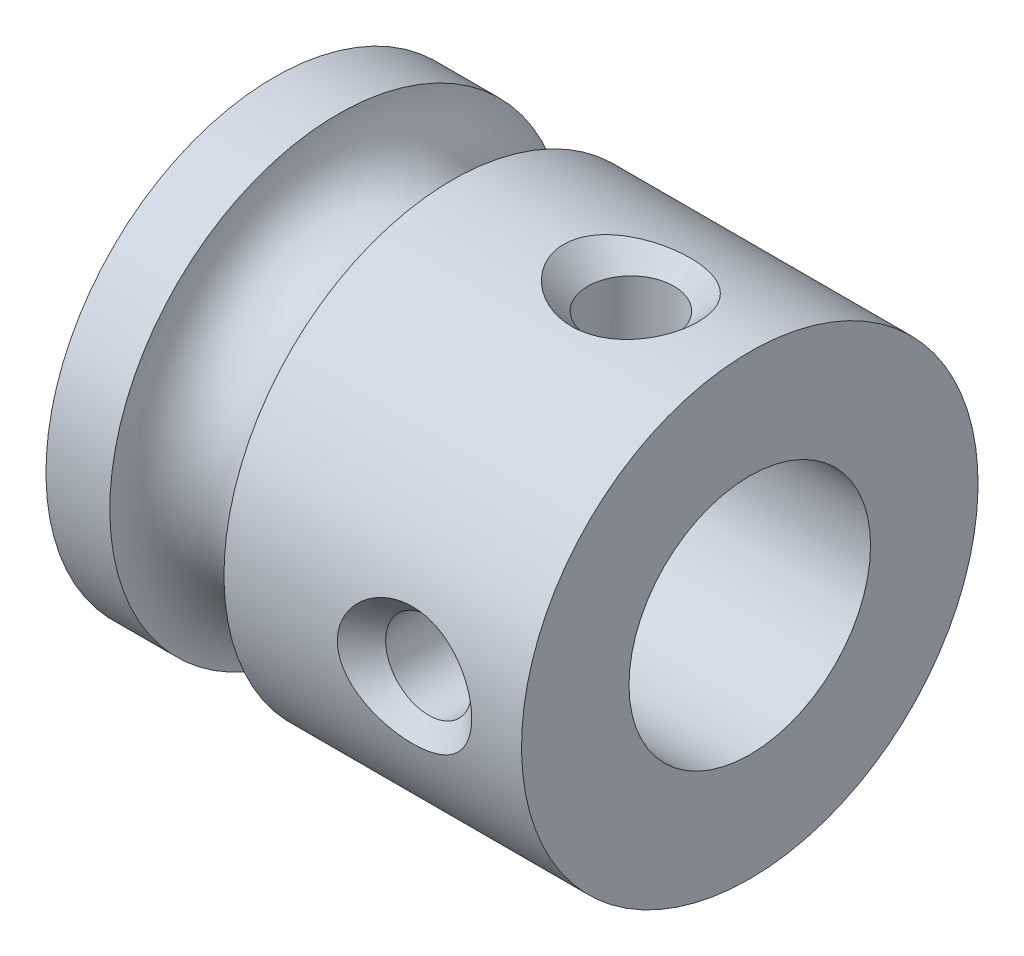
from build123d import *

# Parameters (mm, degrees)
F_1_4_0_25_DIAMETER_HOLE1_D = 6.35


with BuildPart() as part:
    # Sketch1 → Revolve1 (revolve)
    with BuildSketch(Plane.XY, mode=Mode.PRIVATE) as revolve1_sk:
        with BuildLine():
            Line((-6.25, 6), (-4.571460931, 6))
            ThreePointArc((-4.571460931, 6), (-3.071460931, 4.5), (-1.571460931, 6))
            Line((-1.571460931, 6), (6.25, 6))
            Line((6.25, 6), (6.25, 0))
            Line((6.25, 0), (-6.25, 0))
            Line((-6.25, 0), (-6.25, 6))
        make_face()
    revolve(revolve1_sk.sketch.rotate(Axis((-27.982188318, 0, 0), (1, 0, 0)), 180), axis=Axis((-27.982188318, 0, 0), (1, 0, 0)))

    # 1_4 _0.25_ Diameter Hole1 (through all)
    with Locations(Plane(origin=(6.25, 0, 0), x_dir=(0, 0, -1), z_dir=(1, 0, 0))):
        with Locations((0, 0)):
            Hole(F_1_4_0_25_DIAMETER_HOLE1_D / 2)

    # Sketch9 → 4-40 Tapped Hole3 (revolve, cut)
    with BuildSketch(Plane(origin=(3.125, 0, 0), x_dir=(0, 0, -1), z_dir=(1, 0, 0))):
        Polygon((0, 0), (0, 6), (1.7653, 6), (1.1303, 5.365), (1.1303, 0), align=None)
    revolve(axis=Axis((3.125, -6.35, 0), (0, 1, 0)), mode=Mode.SUBTRACT)

    # Sketch13 → 4-40 Tapped Hole4 (revolve, cut)
    with BuildSketch(Plane.YZ.offset(3.175)):
        Polygon((0, 0), (0, 6), (1.7653, 6), (1.1303, 5.365), (1.1303, 0), align=None)
    revolve(axis=Axis((3.175, 0, -6.35), (0, 0, 1)), mode=Mode.SUBTRACT)


solid = part.part
